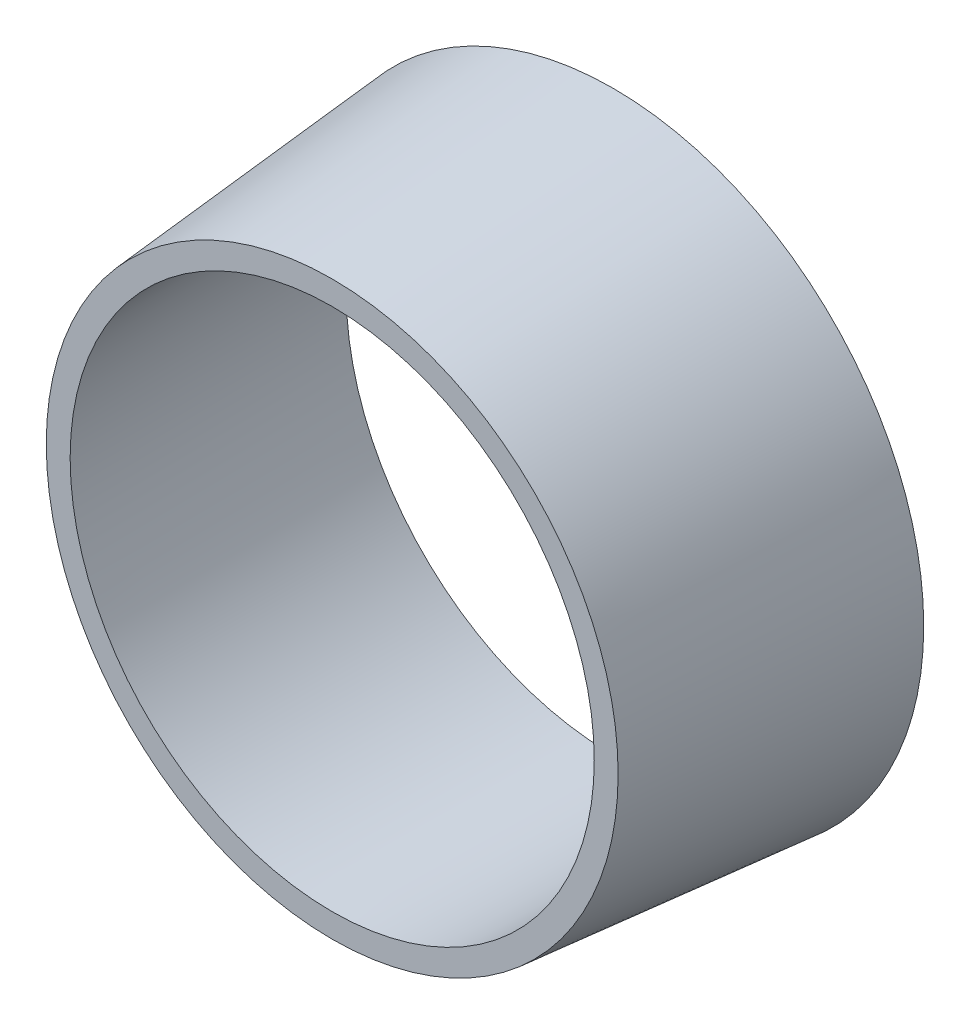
from build123d import *

# Parameters (mm, degrees)
ESQUISSE1_R             = 5.525
BOSS_EXTRU_1_DEPTH      = 5
BOSS_EXTRU_1_TAPER      = 5
ESQUISSE2_R             = 4.75
ENL_V_MAT_EXTRU_1_DEPTH = 10
ENL_V_MAT_EXTRU_1_DRAFT = -1


with BuildPart() as part:
    # Esquisse1 → Boss.-Extru.1 (new body)
    with BuildSketch(Plane.XY):
        Circle(ESQUISSE1_R)
    extrude(amount=BOSS_EXTRU_1_DEPTH, taper=BOSS_EXTRU_1_TAPER)


with BuildPart() as enl_v_mat_extru_1_tool:
    # Esquisse2 → Enl_v. mat.-Extru.1 (with draft: the straight prism first)
    with BuildSketch(Plane(origin=(0, 0, 0), x_dir=(-1, 0, 0), z_dir=(0, 0, -1))):
        Circle(ESQUISSE2_R)
    extrude(amount=-ENL_V_MAT_EXTRU_1_DEPTH)
    # Enl_v. mat.-Extru.1: the draft: its side faces are tilted about the plane it starts from
    enl_v_mat_extru_1_sides = [enl_v_mat_extru_1_tool.faces().sort_by_distance(p)[0] for p in [
        (4.75, 0, 5),
    ]]
    draft(enl_v_mat_extru_1_sides, Plane(origin=(0, 0, 0), x_dir=(-1, 0, 0), z_dir=(0, 0, -1)), ENL_V_MAT_EXTRU_1_DRAFT)


with BuildPart() as part_1:
    add(part.part)

    # Enl_v. mat.-Extru.1: cut by enl_v_mat_extru_1_tool
    add(enl_v_mat_extru_1_tool.part, mode=Mode.SUBTRACT)


solid = part_1.part
